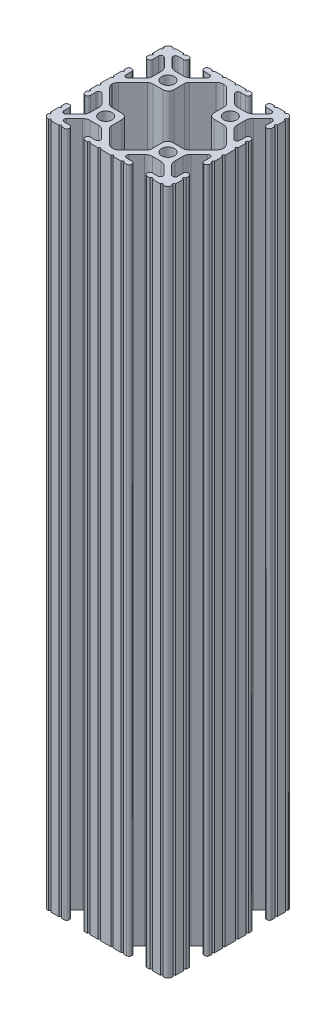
from build123d import *

# Parameters (mm, degrees)
SKETCH1_R      = 2.6035
EXTRUDE1_DEPTH = 139.7


with BuildPart() as part:
    # Sketch1 → Extrude1 (new, symmetric)
    with BuildSketch(Plane(origin=(0, 0, 0), x_dir=(0, 0, -1), z_dir=(0, 1, 0))):
        with BuildLine():
            Line((7.457926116, -25.399784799), (8.405129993, -25.399784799))
            ThreePointArc((8.405129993, -25.399784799), (9.151169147, -25.100147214), (9.461499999, -24.358492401))
            Line((9.461499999, -24.358492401), (9.461499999, -24.231492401))
            ThreePointArc((9.461499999, -24.231492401), (9.151169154, -23.489837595), (8.405130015, -23.190200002))
            Line((8.405130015, -23.190200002), (6.087754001, -23.190200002))
            ThreePointArc((6.087754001, -23.190200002), (5.173448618, -22.579280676), (5.387974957, -21.500783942))
            Line((5.387974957, -21.500783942), (8.763022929, -18.12573597))
            ThreePointArc((8.763022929, -18.12573597), (9.793067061, -17.437482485), (11.008086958, -17.195800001))
            Line((11.008086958, -17.195800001), (14.391913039, -17.195800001))
            ThreePointArc((14.391913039, -17.195800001), (15.606932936, -17.437482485), (16.636977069, -18.12573597))
            Line((16.636977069, -18.12573597), (20.01202504, -21.500783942))
            ThreePointArc((20.01202504, -21.500783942), (20.223734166, -22.586011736), (19.297652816, -23.190092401))
            Line((19.297652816, -23.190092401), (16.979899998, -23.190092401))
            ThreePointArc((16.979899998, -23.190092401), (16.243518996, -23.495111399), (15.938499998, -24.231492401))
            Line((15.938499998, -24.231492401), (15.938499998, -24.358492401))
            ThreePointArc((15.938499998, -24.358492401), (16.248830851, -25.100147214), (16.994870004, -25.399784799))
            Line((16.994870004, -25.399784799), (18.13401566, -25.399784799))
            ThreePointArc((18.13401566, -25.399784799), (18.636212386, -24.81521817), (19.138409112, -25.399784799))
            Line((19.138409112, -25.399784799), (22.413213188, -25.399784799))
            ThreePointArc((22.413213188, -25.399784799), (22.915409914, -24.815218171), (23.41760664, -25.399784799))
            Line((23.41760664, -25.399784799), (23.450078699, -25.399784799))
            ThreePointArc((23.450078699, -25.399784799), (24.83746982, -24.731205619), (25.399999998, -23.297534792))
            Line((25.399999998, -23.297534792), (25.399999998, -23.268649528))
            ThreePointArc((25.399999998, -23.268649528), (24.891999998, -22.760649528), (25.399999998, -22.252649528))
            Line((25.399999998, -22.252649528), (25.399999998, -19.025239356))
            ThreePointArc((25.399999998, -19.025239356), (24.891999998, -18.517239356), (25.399999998, -18.009239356))
            Line((25.399999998, -18.009239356), (25.399999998, -16.916041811))
            ThreePointArc((25.399999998, -16.916041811), (25.094981, -16.179660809), (24.358599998, -15.874641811))
            Line((24.358599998, -15.874641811), (24.231599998, -15.874641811))
            ThreePointArc((24.231599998, -15.874641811), (23.495218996, -16.179660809), (23.190199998, -16.916041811))
            Line((23.190199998, -16.916041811), (23.190199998, -19.10098879))
            ThreePointArc((23.190199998, -19.10098879), (22.563006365, -20.039650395), (21.455779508, -19.81940928))
            Line((21.455779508, -19.81940928), (18.278135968, -16.641765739))
            ThreePointArc((18.278135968, -16.641765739), (17.589882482, -15.611721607), (17.348199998, -14.396701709))
            Line((17.348199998, -14.396701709), (17.348199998, -11.003495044))
            ThreePointArc((17.348199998, -11.003495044), (17.59061076, -9.786718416), (18.280826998, -8.755743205))
            Line((18.280826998, -8.755743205), (21.456640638, -5.587529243))
            ThreePointArc((21.456640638, -5.587529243), (22.563568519, -5.368381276), (23.190199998, -6.306809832))
            Line((23.190199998, -6.306809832), (23.190199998, -8.483958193))
            ThreePointArc((23.190199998, -8.483958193), (23.495218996, -9.220339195), (24.231599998, -9.525358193))
            Line((24.231599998, -9.525358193), (24.358599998, -9.525358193))
            ThreePointArc((24.358599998, -9.525358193), (25.094981, -9.220339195), (25.399999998, -8.483958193))
            Line((25.399999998, -8.483958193), (25.399999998, -7.327686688))
            ThreePointArc((25.399999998, -7.327686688), (24.891999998, -6.819686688), (25.399999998, -6.311686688))
            Line((25.399999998, -6.311686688), (25.399999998, -3.084276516))
            ThreePointArc((25.399999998, -3.084276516), (24.891999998, -2.576276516), (25.399999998, -2.068276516))
            Line((25.399999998, -2.068276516), (25.399999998, 2.068276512))
            ThreePointArc((25.399999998, 2.068276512), (24.891999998, 2.576276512), (25.399999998, 3.084276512))
            Line((25.399999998, 3.084276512), (25.399999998, 6.311686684))
            ThreePointArc((25.399999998, 6.311686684), (24.891999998, 6.819686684), (25.399999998, 7.327686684))
            Line((25.399999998, 7.327686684), (25.399999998, 8.483958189))
            ThreePointArc((25.399999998, 8.483958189), (25.094981, 9.220339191), (24.358599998, 9.525358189))
            Line((24.358599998, 9.525358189), (24.231599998, 9.525358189))
            ThreePointArc((24.231599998, 9.525358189), (23.495218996, 9.220339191), (23.190199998, 8.483958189))
            Line((23.190199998, 8.483958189), (23.190199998, 6.306809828))
            ThreePointArc((23.190199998, 6.306809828), (22.563568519, 5.368381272), (21.456640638, 5.58752924))
            Line((21.456640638, 5.58752924), (18.280826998, 8.755743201))
            ThreePointArc((18.280826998, 8.755743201), (17.59061076, 9.786718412), (17.348199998, 11.00349504))
            Line((17.348199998, 11.00349504), (17.348199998, 14.396701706))
            ThreePointArc((17.348199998, 14.396701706), (17.589882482, 15.611721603), (18.278135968, 16.641765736))
            Line((18.278135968, 16.641765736), (21.455779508, 19.819409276))
            ThreePointArc((21.455779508, 19.819409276), (22.563006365, 20.039650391), (23.190199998, 19.100988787))
            Line((23.190199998, 19.100988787), (23.190199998, 16.916041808))
            ThreePointArc((23.190199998, 16.916041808), (23.495218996, 16.179660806), (24.231599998, 15.874641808))
            Line((24.231599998, 15.874641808), (24.358599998, 15.874641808))
            ThreePointArc((24.358599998, 15.874641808), (25.094981, 16.179660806), (25.399999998, 16.916041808))
            Line((25.399999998, 16.916041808), (25.399999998, 18.009239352))
            ThreePointArc((25.399999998, 18.009239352), (24.891999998, 18.517239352), (25.399999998, 19.025239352))
            Line((25.399999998, 19.025239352), (25.399999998, 22.252649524))
            ThreePointArc((25.399999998, 22.252649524), (24.891999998, 22.760649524), (25.399999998, 23.268649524))
            Line((25.399999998, 23.268649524), (25.399999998, 23.297534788))
            ThreePointArc((25.399999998, 23.297534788), (24.837469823, 24.731205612), (23.450078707, 25.399784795))
            Line((23.450078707, 25.399784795), (23.417606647, 25.399784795))
            ThreePointArc((23.417606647, 25.399784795), (22.915409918, 24.81521819), (22.413213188, 25.399784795))
            Line((22.413213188, 25.399784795), (19.138409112, 25.399784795))
            ThreePointArc((19.138409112, 25.399784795), (18.636212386, 24.815218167), (18.13401566, 25.399784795))
            Line((18.13401566, 25.399784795), (16.994870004, 25.399784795))
            ThreePointArc((16.994870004, 25.399784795), (16.248830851, 25.100147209), (15.938499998, 24.358492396))
            Line((15.938499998, 24.358492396), (15.938499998, 24.231492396))
            ThreePointArc((15.938499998, 24.231492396), (16.243518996, 23.495111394), (16.979899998, 23.190092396))
            Line((16.979899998, 23.190092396), (19.297652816, 23.190092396))
            ThreePointArc((19.297652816, 23.190092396), (20.223734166, 22.586011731), (20.01202504, 21.500783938))
            Line((20.01202504, 21.500783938), (16.636977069, 18.125735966))
            ThreePointArc((16.636977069, 18.125735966), (15.606932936, 17.437482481), (14.391913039, 17.195799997))
            Line((14.391913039, 17.195799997), (11.008086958, 17.195799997))
            ThreePointArc((11.008086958, 17.195799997), (9.793067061, 17.437482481), (8.763022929, 18.125735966))
            Line((8.763022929, 18.125735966), (5.387974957, 21.500783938))
            ThreePointArc((5.387974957, 21.500783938), (5.173448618, 22.579280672), (6.087754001, 23.190199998))
            Line((6.087754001, 23.190199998), (8.405130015, 23.190199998))
            ThreePointArc((8.405130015, 23.190199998), (9.151169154, 23.48983759), (9.461499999, 24.231492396))
            Line((9.461499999, 24.231492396), (9.461499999, 24.358492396))
            ThreePointArc((9.461499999, 24.358492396), (9.151169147, 25.10014721), (8.405129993, 25.399784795))
            Line((8.405129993, 25.399784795), (7.457926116, 25.399784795))
            ThreePointArc((7.457926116, 25.399784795), (6.95572939, 24.815218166), (6.453532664, 25.399784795))
            Line((6.453532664, 25.399784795), (3.214515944, 25.399784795))
            ThreePointArc((3.214515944, 25.399784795), (2.712319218, 24.815218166), (2.210122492, 25.399784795))
            Line((2.210122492, 25.399784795), (-2.210122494, 25.399784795))
            ThreePointArc((-2.210122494, 25.399784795), (-2.71231922, 24.815218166), (-3.214515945, 25.399784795))
            Line((-3.214515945, 25.399784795), (-6.453532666, 25.399784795))
            ThreePointArc((-6.453532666, 25.399784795), (-6.955729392, 24.815218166), (-7.457926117, 25.399784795))
            Line((-7.457926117, 25.399784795), (-8.405129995, 25.399784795))
            ThreePointArc((-8.405129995, 25.399784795), (-9.151169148, 25.10014721), (-9.461500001, 24.358492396))
            Line((-9.461500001, 24.358492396), (-9.461500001, 24.231492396))
            ThreePointArc((-9.461500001, 24.231492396), (-9.151169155, 23.48983759), (-8.405130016, 23.190199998))
            Line((-8.405130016, 23.190199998), (-6.087754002, 23.190199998))
            ThreePointArc((-6.087754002, 23.190199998), (-5.173448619, 22.579280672), (-5.387974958, 21.500783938))
            Line((-5.387974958, 21.500783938), (-8.76302293, 18.125735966))
            ThreePointArc((-8.76302293, 18.125735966), (-9.793067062, 17.437482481), (-11.00808696, 17.195799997))
            Line((-11.00808696, 17.195799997), (-14.39191304, 17.195799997))
            ThreePointArc((-14.39191304, 17.195799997), (-15.606932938, 17.437482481), (-16.63697707, 18.125735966))
            Line((-16.63697707, 18.125735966), (-20.012025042, 21.500783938))
            ThreePointArc((-20.012025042, 21.500783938), (-20.223734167, 22.586011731), (-19.297652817, 23.190092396))
            Line((-19.297652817, 23.190092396), (-16.979899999, 23.190092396))
            ThreePointArc((-16.979899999, 23.190092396), (-16.243518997, 23.495111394), (-15.938499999, 24.231492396))
            Line((-15.938499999, 24.231492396), (-15.938499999, 24.358492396))
            ThreePointArc((-15.938499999, 24.358492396), (-16.248830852, 25.100147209), (-16.994870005, 25.399784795))
            Line((-16.994870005, 25.399784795), (-18.134015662, 25.399784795))
            ThreePointArc((-18.134015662, 25.399784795), (-18.636212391, 24.815218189), (-19.13840912, 25.399784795))
            Line((-19.13840912, 25.399784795), (-22.413213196, 25.399784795))
            ThreePointArc((-22.413213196, 25.399784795), (-22.915409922, 24.815218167), (-23.417606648, 25.399784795))
            Line((-23.417606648, 25.399784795), (-23.450078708, 25.399784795))
            ThreePointArc((-23.450078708, 25.399784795), (-24.837469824, 24.731205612), (-25.399999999, 23.297534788))
            Line((-25.399999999, 23.297534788), (-25.399999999, 23.268649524))
            ThreePointArc((-25.399999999, 23.268649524), (-24.891999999, 22.760649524), (-25.399999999, 22.252649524))
            Line((-25.399999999, 22.252649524), (-25.399999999, 19.025239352))
            ThreePointArc((-25.399999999, 19.025239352), (-24.891999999, 18.517239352), (-25.399999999, 18.009239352))
            Line((-25.399999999, 18.009239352), (-25.399999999, 16.916041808))
            ThreePointArc((-25.399999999, 16.916041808), (-25.094981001, 16.179660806), (-24.358599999, 15.874641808))
            Line((-24.358599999, 15.874641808), (-24.231599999, 15.874641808))
            ThreePointArc((-24.231599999, 15.874641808), (-23.495218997, 16.179660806), (-23.190199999, 16.916041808))
            Line((-23.190199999, 16.916041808), (-23.190199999, 19.100988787))
            ThreePointArc((-23.190199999, 19.100988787), (-22.563006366, 20.039650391), (-21.45577951, 19.819409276))
            Line((-21.45577951, 19.819409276), (-18.278135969, 16.641765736))
            ThreePointArc((-18.278135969, 16.641765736), (-17.589882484, 15.611721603), (-17.348199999, 14.396701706))
            Line((-17.348199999, 14.396701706), (-17.348199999, 11.00349504))
            ThreePointArc((-17.348199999, 11.00349504), (-17.590610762, 9.786718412), (-18.280826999, 8.755743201))
            Line((-18.280826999, 8.755743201), (-21.456640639, 5.58752924))
            ThreePointArc((-21.456640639, 5.58752924), (-22.56356852, 5.368381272), (-23.190199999, 6.306809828))
            Line((-23.190199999, 6.306809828), (-23.190199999, 8.483958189))
            ThreePointArc((-23.190199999, 8.483958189), (-23.495218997, 9.220339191), (-24.231599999, 9.525358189))
            Line((-24.231599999, 9.525358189), (-24.358599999, 9.525358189))
            ThreePointArc((-24.358599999, 9.525358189), (-25.094981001, 9.220339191), (-25.399999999, 8.483958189))
            Line((-25.399999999, 8.483958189), (-25.399999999, 7.327686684))
            ThreePointArc((-25.399999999, 7.327686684), (-24.891999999, 6.819686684), (-25.399999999, 6.311686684))
            Line((-25.399999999, 6.311686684), (-25.399999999, 3.084276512))
            ThreePointArc((-25.399999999, 3.084276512), (-24.891999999, 2.576276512), (-25.399999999, 2.068276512))
            Line((-25.399999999, 2.068276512), (-25.399999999, -2.068276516))
            ThreePointArc((-25.399999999, -2.068276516), (-24.891999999, -2.576276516), (-25.399999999, -3.084276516))
            Line((-25.399999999, -3.084276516), (-25.399999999, -6.311686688))
            ThreePointArc((-25.399999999, -6.311686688), (-24.891999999, -6.819686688), (-25.399999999, -7.327686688))
            Line((-25.399999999, -7.327686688), (-25.399999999, -8.483958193))
            ThreePointArc((-25.399999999, -8.483958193), (-25.094981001, -9.220339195), (-24.358599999, -9.525358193))
            Line((-24.358599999, -9.525358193), (-24.231599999, -9.525358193))
            ThreePointArc((-24.231599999, -9.525358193), (-23.495218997, -9.220339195), (-23.190199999, -8.483958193))
            Line((-23.190199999, -8.483958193), (-23.190199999, -6.306809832))
            ThreePointArc((-23.190199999, -6.306809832), (-22.56356852, -5.368381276), (-21.456640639, -5.587529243))
            Line((-21.456640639, -5.587529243), (-18.280826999, -8.755743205))
            ThreePointArc((-18.280826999, -8.755743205), (-17.590610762, -9.786718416), (-17.348199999, -11.003495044))
            Line((-17.348199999, -11.003495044), (-17.348199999, -14.396701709))
            ThreePointArc((-17.348199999, -14.396701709), (-17.589882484, -15.611721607), (-18.278135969, -16.641765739))
            Line((-18.278135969, -16.641765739), (-21.45577951, -19.81940928))
            ThreePointArc((-21.45577951, -19.81940928), (-22.563006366, -20.039650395), (-23.190199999, -19.10098879))
            Line((-23.190199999, -19.10098879), (-23.190199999, -16.916041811))
            ThreePointArc((-23.190199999, -16.916041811), (-23.495218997, -16.179660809), (-24.231599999, -15.874641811))
            Line((-24.231599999, -15.874641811), (-24.358599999, -15.874641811))
            ThreePointArc((-24.358599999, -15.874641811), (-25.094981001, -16.179660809), (-25.399999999, -16.916041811))
            Line((-25.399999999, -16.916041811), (-25.399999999, -18.009239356))
            ThreePointArc((-25.399999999, -18.009239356), (-24.891999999, -18.517239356), (-25.399999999, -19.025239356))
            Line((-25.399999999, -19.025239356), (-25.399999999, -22.252649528))
            ThreePointArc((-25.399999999, -22.252649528), (-24.891999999, -22.760649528), (-25.399999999, -23.268649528))
            Line((-25.399999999, -23.268649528), (-25.399999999, -23.297534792))
            ThreePointArc((-25.399999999, -23.297534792), (-24.837469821, -24.731205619), (-23.450078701, -25.399784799))
            Line((-23.450078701, -25.399784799), (-23.417606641, -25.399784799))
            ThreePointArc((-23.417606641, -25.399784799), (-22.915409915, -24.81521817), (-22.413213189, -25.399784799))
            Line((-22.413213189, -25.399784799), (-19.138409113, -25.399784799))
            ThreePointArc((-19.138409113, -25.399784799), (-18.636212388, -24.81521817), (-18.134015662, -25.399784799))
            Line((-18.134015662, -25.399784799), (-16.994870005, -25.399784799))
            ThreePointArc((-16.994870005, -25.399784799), (-16.248830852, -25.100147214), (-15.938499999, -24.358492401))
            Line((-15.938499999, -24.358492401), (-15.938499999, -24.231492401))
            ThreePointArc((-15.938499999, -24.231492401), (-16.243518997, -23.495111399), (-16.979899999, -23.190092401))
            Line((-16.979899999, -23.190092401), (-19.297652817, -23.190092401))
            ThreePointArc((-19.297652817, -23.190092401), (-20.223734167, -22.586011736), (-20.012025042, -21.500783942))
            Line((-20.012025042, -21.500783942), (-16.63697707, -18.12573597))
            ThreePointArc((-16.63697707, -18.12573597), (-15.606932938, -17.437482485), (-14.39191304, -17.195800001))
            Line((-14.39191304, -17.195800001), (-11.00808696, -17.195800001))
            ThreePointArc((-11.00808696, -17.195800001), (-9.793067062, -17.437482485), (-8.76302293, -18.12573597))
            Line((-8.76302293, -18.12573597), (-5.387974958, -21.500783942))
            ThreePointArc((-5.387974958, -21.500783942), (-5.173448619, -22.579280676), (-6.087754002, -23.190200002))
            Line((-6.087754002, -23.190200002), (-8.405130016, -23.190200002))
            ThreePointArc((-8.405130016, -23.190200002), (-9.151169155, -23.489837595), (-9.461500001, -24.231492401))
            Line((-9.461500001, -24.231492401), (-9.461500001, -24.358492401))
            ThreePointArc((-9.461500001, -24.358492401), (-9.151169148, -25.100147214), (-8.405129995, -25.399784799))
            Line((-8.405129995, -25.399784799), (-7.457926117, -25.399784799))
            ThreePointArc((-7.457926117, -25.399784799), (-6.955729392, -24.81521817), (-6.453532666, -25.399784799))
            Line((-6.453532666, -25.399784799), (-3.214515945, -25.399784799))
            ThreePointArc((-3.214515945, -25.399784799), (-2.71231922, -24.81521817), (-2.210122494, -25.399784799))
            Line((-2.210122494, -25.399784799), (2.210122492, -25.399784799))
            ThreePointArc((2.210122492, -25.399784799), (2.712319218, -24.81521817), (3.214515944, -25.399784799))
            Line((3.214515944, -25.399784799), (6.453532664, -25.399784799))
            ThreePointArc((6.453532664, -25.399784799), (6.95572939, -24.815218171), (7.457926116, -25.399784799))
        make_face()
        with Locations(Location((12.7, 12.7, 0), (0, 0, 180))):
            Circle(SKETCH1_R, mode=Mode.SUBTRACT)
        with Locations(Location((-12.7, 12.7, 0), (0, 0, 180))):
            Circle(SKETCH1_R, mode=Mode.SUBTRACT)
        with Locations(Location((-12.7, -12.7, 0), (0, 0, 180))):
            Circle(SKETCH1_R, mode=Mode.SUBTRACT)
        with Locations(Location((12.7, -12.7, 0), (0, 0, 180))):
            Circle(SKETCH1_R, mode=Mode.SUBTRACT)
        with BuildLine():
            Line((-7.683964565, -16.079665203), (-1.987770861, -21.775858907))
            ThreePointArc((-1.987770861, -21.775858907), (-1.075921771, -22.393947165), (0, -22.630366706))
            ThreePointArc((0, -22.630366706), (1.07592177, -22.393947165), (1.98777086, -21.775858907))
            Line((1.98777086, -21.775858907), (7.683964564, -16.079665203))
            ThreePointArc((7.683964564, -16.079665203), (8.16298899, -15.362754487), (8.331199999, -14.517100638))
            Line((8.331199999, -14.517100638), (8.331199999, -10.3886))
            ThreePointArc((8.331199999, -10.3886), (8.978435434, -8.826035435), (10.540999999, -8.1788))
            Line((10.540999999, -8.1788), (14.816495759, -8.1788))
            ThreePointArc((14.816495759, -8.1788), (15.66092662, -8.01109514), (16.377187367, -7.53343528))
            Line((16.377187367, -7.53343528), (21.773383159, -2.150152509))
            ThreePointArc((21.773383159, -2.150152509), (22.408382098, -1.201655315), (22.631399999, -0.082220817))
            Line((22.631399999, -0.082220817), (22.631399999, 0.082220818))
            ThreePointArc((22.631399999, 0.082220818), (22.408382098, 1.201655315), (21.773383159, 2.150152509))
            Line((21.773383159, 2.150152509), (16.376754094, 7.533867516))
            ThreePointArc((16.376754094, 7.533867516), (15.660493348, 8.011527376), (14.816062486, 8.179232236))
            Line((14.816062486, 8.179232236), (10.540999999, 8.179232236))
            ThreePointArc((10.540999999, 8.179232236), (8.978435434, 8.826467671), (8.331199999, 10.389032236))
            Line((8.331199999, 10.389032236), (8.331199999, 14.517100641))
            ThreePointArc((8.331199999, 14.517100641), (8.16298899, 15.362754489), (7.683964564, 16.079665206))
            Line((7.683964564, 16.079665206), (1.795557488, 21.968072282))
            ThreePointArc((1.795557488, 21.968072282), (0.971532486, 22.546678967), (1.3e-08, 22.811117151))
            ThreePointArc((1.3e-08, 22.811117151), (-0.971532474, 22.54667897), (-1.795557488, 21.96807228))
            Line((-1.795557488, 21.96807228), (-7.683964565, 16.079665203))
            ThreePointArc((-7.683964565, 16.079665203), (-8.162988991, 15.362754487), (-8.3312, 14.517100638))
            Line((-8.3312, 14.517100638), (-8.3312, 10.3886))
            ThreePointArc((-8.3312, 10.3886), (-8.978435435, 8.826035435), (-10.541, 8.1788))
            Line((-10.541, 8.1788), (-14.816495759, 8.1788))
            ThreePointArc((-14.816495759, 8.1788), (-15.660926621, 8.01109514), (-16.377187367, 7.53343528))
            Line((-16.377187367, 7.53343528), (-21.77338316, 2.150152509))
            ThreePointArc((-21.77338316, 2.150152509), (-22.408382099, 1.201655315), (-22.6314, 0.082220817))
            Line((-22.6314, 0.082220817), (-22.6314, -0.082220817))
            ThreePointArc((-22.6314, -0.082220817), (-22.408382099, -1.201655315), (-21.77338316, -2.150152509))
            Line((-21.77338316, -2.150152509), (-16.377187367, -7.53343528))
            ThreePointArc((-16.377187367, -7.53343528), (-15.660926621, -8.01109514), (-14.816495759, -8.1788))
            Line((-14.816495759, -8.1788), (-10.541, -8.1788))
            ThreePointArc((-10.541, -8.1788), (-8.978435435, -8.826035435), (-8.3312, -10.3886))
            Line((-8.3312, -10.3886), (-8.3312, -14.517100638))
            ThreePointArc((-8.3312, -14.517100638), (-8.162988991, -15.362754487), (-7.683964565, -16.079665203))
        make_face(mode=Mode.SUBTRACT)
    extrude(amount=EXTRUDE1_DEPTH, both=True)


solid = part.part
